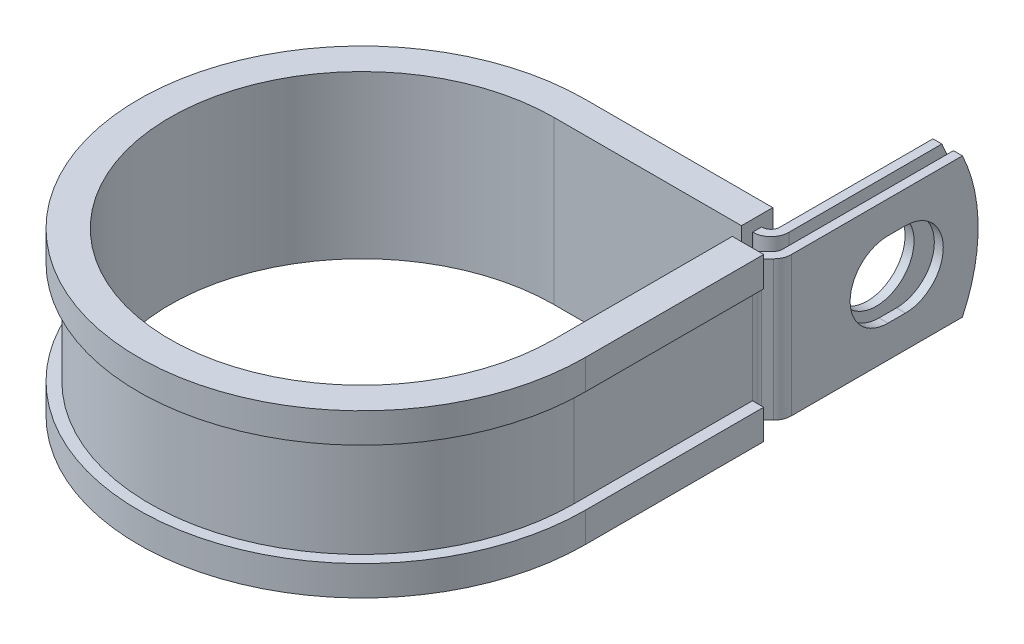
ISO-10303-21;
HEADER;
FILE_DESCRIPTION(('STEP AP214'),'2;1');
FILE_NAME('part.step','',(''),(''),'','','');
FILE_SCHEMA(('AUTOMOTIVE_DESIGN { 1 0 10303 214 1 1 1 1 }'));
ENDSEC;
DATA;
#1=APPLICATION_CONTEXT('core data for automotive mechanical design processes');
#2=APPLICATION_PROTOCOL_DEFINITION('international standard','automotive_design',2000,#1);
#3=PRODUCT_CONTEXT('',#1,'mechanical');
#4=PRODUCT('Part','Part','',(#3));
#5=PRODUCT_RELATED_PRODUCT_CATEGORY('part','',(#4));
#6=PRODUCT_DEFINITION_FORMATION('','',#4);
#7=PRODUCT_DEFINITION_CONTEXT('part definition',#1,'design');
#8=PRODUCT_DEFINITION('design','',#6,#7);
#9=PRODUCT_DEFINITION_SHAPE('','',#8);
#10=(LENGTH_UNIT() NAMED_UNIT(*) SI_UNIT(.MILLI.,.METRE.));
#11=(NAMED_UNIT(*) PLANE_ANGLE_UNIT() SI_UNIT($,.RADIAN.));
#12=(NAMED_UNIT(*) SI_UNIT($,.STERADIAN.) SOLID_ANGLE_UNIT());
#13=UNCERTAINTY_MEASURE_WITH_UNIT(LENGTH_MEASURE(1.E-05),#10,'distance_accuracy_value','');
#14=(GEOMETRIC_REPRESENTATION_CONTEXT(3) GLOBAL_UNCERTAINTY_ASSIGNED_CONTEXT((#13)) GLOBAL_UNIT_ASSIGNED_CONTEXT((#10,
#11,#12)) REPRESENTATION_CONTEXT('',''));
#15=CARTESIAN_POINT('',(0.,0.,0.));
#16=DIRECTION('',(0.,0.,1.));
#17=DIRECTION('',(1.,0.,0.));
#18=AXIS2_PLACEMENT_3D('',#15,#16,#17);
#19=CARTESIAN_POINT('',(28.3896698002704,-9.525,-27.7114));
#20=DIRECTION('',(0.,1.,0.));
#21=DIRECTION('',(1.,0.,0.));
#22=AXIS2_PLACEMENT_3D('',#19,#20,#21);
#23=PLANE('',#22);
#24=DIRECTION('',(0.,0.,-1.));
#25=VECTOR('',#24,1.);
#26=CARTESIAN_POINT('',(25.5448698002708,-9.525,-27.7114));
#27=LINE('',#26,#25);
#28=CARTESIAN_POINT('',(25.5448698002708,-9.525,-27.7114));
#29=VERTEX_POINT('',#28);
#30=CARTESIAN_POINT('',(25.5448698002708,-9.525,-28.9306));
#31=VERTEX_POINT('',#30);
#32=EDGE_CURVE('E505',#29,#31,#27,.T.);
#33=ORIENTED_EDGE('',*,*,#32,.T.);
#34=DIRECTION('',(-1.,0.,0.));
#35=VECTOR('',#34,1.);
#36=CARTESIAN_POINT('',(0.,-9.525,-28.9306));
#37=LINE('',#36,#35);
#38=CARTESIAN_POINT('',(25.5956698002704,-9.525,-28.9306));
#39=VERTEX_POINT('',#38);
#40=EDGE_CURVE('E392',#39,#31,#37,.T.);
#41=ORIENTED_EDGE('',*,*,#40,.F.);
#42=CARTESIAN_POINT('',(25.5956698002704,-9.525,-30.1498));
#43=DIRECTION('',(0.,1.,0.));
#44=DIRECTION('',(1.,0.,0.));
#45=AXIS2_PLACEMENT_3D('',#42,#43,#44);
#46=CIRCLE('',#45,1.2192);
#47=CARTESIAN_POINT('',(26.8148698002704,-9.525,-30.1498));
#48=VERTEX_POINT('',#47);
#49=EDGE_CURVE('E390',#48,#39,#46,.F.);
#50=ORIENTED_EDGE('',*,*,#49,.F.);
#51=DIRECTION('',(0.,0.,1.));
#52=VECTOR('',#51,1.);
#53=CARTESIAN_POINT('',(26.8148698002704,-9.525,-53.1622));
#54=LINE('',#53,#52);
#55=CARTESIAN_POINT('',(26.8148698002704,-9.525,-51.0176631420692));
#56=VERTEX_POINT('',#55);
#57=EDGE_CURVE('E388',#56,#48,#54,.T.);
#58=ORIENTED_EDGE('',*,*,#57,.F.);
#59=DIRECTION('',(-1.,0.,0.));
#60=VECTOR('',#59,1.);
#61=CARTESIAN_POINT('',(30.8280698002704,-9.525,-51.0176631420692));
#62=LINE('',#61,#60);
#63=CARTESIAN_POINT('',(28.0340698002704,-9.525,-51.0176631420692));
#64=VERTEX_POINT('',#63);
#65=EDGE_CURVE('E11',#64,#56,#62,.T.);
#66=ORIENTED_EDGE('',*,*,#65,.F.);
#67=DIRECTION('',(0.,0.,1.));
#68=VECTOR('',#67,1.);
#69=CARTESIAN_POINT('',(28.0340698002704,-9.525,-53.1622));
#70=LINE('',#69,#68);
#71=CARTESIAN_POINT('',(28.0340698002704,-9.525,-30.1498));
#72=VERTEX_POINT('',#71);
#73=EDGE_CURVE('E386',#64,#72,#70,.T.);
#74=ORIENTED_EDGE('',*,*,#73,.T.);
#75=CARTESIAN_POINT('',(25.5956698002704,-9.525,-30.1498));
#76=DIRECTION('',(0.,-1.,0.));
#77=DIRECTION('',(0.,0.,1.));
#78=AXIS2_PLACEMENT_3D('',#75,#76,#77);
#79=CIRCLE('',#78,2.4384);
#80=CARTESIAN_POINT('',(25.5956698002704,-9.525,-27.7114));
#81=VERTEX_POINT('',#80);
#82=EDGE_CURVE('E383',#72,#81,#79,.T.);
#83=ORIENTED_EDGE('',*,*,#82,.T.);
#84=DIRECTION('',(-1.,0.,0.));
#85=VECTOR('',#84,1.);
#86=CARTESIAN_POINT('',(0.,-9.525,-27.7114));
#87=LINE('',#86,#85);
#88=EDGE_CURVE('E380',#81,#29,#87,.T.);
#89=ORIENTED_EDGE('',*,*,#88,.T.);
#90=EDGE_LOOP('',(#33,#41,#50,#58,#66,#74,#83,#89));
#91=FACE_BOUND('',#90,.T.);
#92=ADVANCED_FACE('F36',(#91),#23,.F.);
#93=CARTESIAN_POINT('',(28.3896698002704,9.525,-27.7114));
#94=DIRECTION('',(0.,1.,0.));
#95=DIRECTION('',(1.,0.,0.));
#96=AXIS2_PLACEMENT_3D('',#93,#94,#95);
#97=PLANE('',#96);
#98=DIRECTION('',(-1.,0.,0.));
#99=VECTOR('',#98,1.);
#100=CARTESIAN_POINT('',(0.,9.525,-28.9306));
#101=LINE('',#100,#99);
#102=CARTESIAN_POINT('',(25.5956698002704,9.525,-28.9306));
#103=VERTEX_POINT('',#102);
#104=CARTESIAN_POINT('',(25.5448698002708,9.525,-28.9306));
#105=VERTEX_POINT('',#104);
#106=EDGE_CURVE('E350',#103,#105,#101,.T.);
#107=ORIENTED_EDGE('',*,*,#106,.T.);
#108=DIRECTION('',(0.,0.,1.));
#109=VECTOR('',#108,1.);
#110=CARTESIAN_POINT('',(25.5448698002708,9.525,-28.9306));
#111=LINE('',#110,#109);
#112=CARTESIAN_POINT('',(25.5448698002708,9.525,-27.7114));
#113=VERTEX_POINT('',#112);
#114=EDGE_CURVE('E499',#105,#113,#111,.T.);
#115=ORIENTED_EDGE('',*,*,#114,.T.);
#116=DIRECTION('',(-1.,0.,0.));
#117=VECTOR('',#116,1.);
#118=CARTESIAN_POINT('',(0.,9.525,-27.7114));
#119=LINE('',#118,#117);
#120=CARTESIAN_POINT('',(25.5956698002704,9.525,-27.7114));
#121=VERTEX_POINT('',#120);
#122=EDGE_CURVE('E607',#121,#113,#119,.T.);
#123=ORIENTED_EDGE('',*,*,#122,.F.);
#124=CARTESIAN_POINT('',(25.5956698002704,9.525,-30.1498));
#125=DIRECTION('',(0.,-1.,0.));
#126=DIRECTION('',(0.,0.,1.));
#127=AXIS2_PLACEMENT_3D('',#124,#125,#126);
#128=CIRCLE('',#127,2.4384);
#129=CARTESIAN_POINT('',(28.0340698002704,9.525,-30.1498));
#130=VERTEX_POINT('',#129);
#131=EDGE_CURVE('E352',#130,#121,#128,.T.);
#132=ORIENTED_EDGE('',*,*,#131,.F.);
#133=DIRECTION('',(0.,0.,1.));
#134=VECTOR('',#133,1.);
#135=CARTESIAN_POINT('',(28.0340698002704,9.525,-53.1622));
#136=LINE('',#135,#134);
#137=CARTESIAN_POINT('',(28.0340698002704,9.525,-51.0176631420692));
#138=VERTEX_POINT('',#137);
#139=EDGE_CURVE('E343',#138,#130,#136,.T.);
#140=ORIENTED_EDGE('',*,*,#139,.F.);
#141=DIRECTION('',(-1.,0.,0.));
#142=VECTOR('',#141,1.);
#143=CARTESIAN_POINT('',(30.8280698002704,9.525,-51.0176631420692));
#144=LINE('',#143,#142);
#145=CARTESIAN_POINT('',(26.8148698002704,9.525,-51.0176631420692));
#146=VERTEX_POINT('',#145);
#147=EDGE_CURVE('E44',#138,#146,#144,.T.);
#148=ORIENTED_EDGE('',*,*,#147,.T.);
#149=DIRECTION('',(0.,0.,1.));
#150=VECTOR('',#149,1.);
#151=CARTESIAN_POINT('',(26.8148698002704,9.525,-53.1622));
#152=LINE('',#151,#150);
#153=CARTESIAN_POINT('',(26.8148698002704,9.525,-30.1498));
#154=VERTEX_POINT('',#153);
#155=EDGE_CURVE('E340',#146,#154,#152,.T.);
#156=ORIENTED_EDGE('',*,*,#155,.T.);
#157=CARTESIAN_POINT('',(25.5956698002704,9.525,-30.1498));
#158=DIRECTION('',(0.,1.,0.));
#159=DIRECTION('',(1.,0.,0.));
#160=AXIS2_PLACEMENT_3D('',#157,#158,#159);
#161=CIRCLE('',#160,1.2192);
#162=EDGE_CURVE('E348',#154,#103,#161,.F.);
#163=ORIENTED_EDGE('',*,*,#162,.T.);
#164=EDGE_LOOP('',(#107,#115,#123,#132,#140,#148,#156,#163));
#165=FACE_BOUND('',#164,.T.);
#166=ADVANCED_FACE('F339',(#165),#97,.T.);
#167=CARTESIAN_POINT('',(0.,9.525,-27.7114));
#168=DIRECTION('',(0.,0.,1.));
#169=DIRECTION('',(1.,0.,0.));
#170=AXIS2_PLACEMENT_3D('',#167,#168,#169);
#171=PLANE('',#170);
#172=ORIENTED_EDGE('',*,*,#122,.T.);
#173=DIRECTION('',(0.,-1.,0.));
#174=VECTOR('',#173,1.);
#175=CARTESIAN_POINT('',(25.5448698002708,9.525,-27.7114));
#176=LINE('',#175,#174);
#177=EDGE_CURVE('E502',#113,#29,#176,.T.);
#178=ORIENTED_EDGE('',*,*,#177,.T.);
#179=ORIENTED_EDGE('',*,*,#88,.F.);
#180=DIRECTION('',(0.,-1.,0.));
#181=VECTOR('',#180,1.);
#182=CARTESIAN_POINT('',(25.5956698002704,9.525,-27.7114));
#183=LINE('',#182,#181);
#184=EDGE_CURVE('E326',#121,#81,#183,.T.);
#185=ORIENTED_EDGE('',*,*,#184,.F.);
#186=EDGE_LOOP('',(#172,#178,#179,#185));
#187=FACE_BOUND('',#186,.T.);
#188=ADVANCED_FACE('F617',(#187),#171,.T.);
#189=CARTESIAN_POINT('',(30.8280698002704,9.525,-27.7114));
#190=DIRECTION('',(-1.,0.,0.));
#191=DIRECTION('',(0.,0.,1.));
#192=AXIS2_PLACEMENT_3D('',#189,#190,#191);
#193=PLANE('',#192);
#194=CARTESIAN_POINT('',(30.8280698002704,0.,-43.2561999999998));
#195=DIRECTION('',(1.,0.,0.));
#196=DIRECTION('',(0.,0.,-1.));
#197=AXIS2_PLACEMENT_3D('',#194,#195,#196);
#198=CIRCLE('',#197,5.1562);
#199=CARTESIAN_POINT('',(30.8280698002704,-5.1562,-43.2562000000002));
#200=VERTEX_POINT('',#199);
#201=CARTESIAN_POINT('',(30.8280698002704,5.1562,-43.2562000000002));
#202=VERTEX_POINT('',#201);
#203=EDGE_CURVE('E562',#200,#202,#198,.T.);
#204=ORIENTED_EDGE('',*,*,#203,.F.);
#205=DIRECTION('',(0.,0.,-1.));
#206=VECTOR('',#205,1.);
#207=CARTESIAN_POINT('',(30.8280698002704,-5.1562,-40.8685999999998));
#208=LINE('',#207,#206);
#209=CARTESIAN_POINT('',(30.8280698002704,-5.1562,-40.8685999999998));
#210=VERTEX_POINT('',#209);
#211=EDGE_CURVE('E565',#210,#200,#208,.T.);
#212=ORIENTED_EDGE('',*,*,#211,.F.);
#213=CARTESIAN_POINT('',(30.8280698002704,0.,-40.8685999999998));
#214=DIRECTION('',(1.,0.,0.));
#215=DIRECTION('',(0.,0.,-1.));
#216=AXIS2_PLACEMENT_3D('',#213,#214,#215);
#217=CIRCLE('',#216,5.1562);
#218=CARTESIAN_POINT('',(30.8280698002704,5.1562,-40.8685999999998));
#219=VERTEX_POINT('',#218);
#220=EDGE_CURVE('E558',#219,#210,#217,.T.);
#221=ORIENTED_EDGE('',*,*,#220,.F.);
#222=DIRECTION('',(0.,0.,1.));
#223=VECTOR('',#222,1.);
#224=CARTESIAN_POINT('',(30.8280698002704,5.1562,-40.8685999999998));
#225=LINE('',#224,#223);
#226=EDGE_CURVE('E559',#202,#219,#225,.T.);
#227=ORIENTED_EDGE('',*,*,#226,.F.);
#228=EDGE_LOOP('',(#204,#212,#221,#227));
#229=FACE_BOUND('',#228,.T.);
#230=DIRECTION('',(0.,0.,-1.));
#231=VECTOR('',#230,1.);
#232=CARTESIAN_POINT('',(30.8280698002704,-9.525,-27.7114));
#233=LINE('',#232,#231);
#234=CARTESIAN_POINT('',(30.8280698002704,-9.525,-27.7114));
#235=VERTEX_POINT('',#234);
#236=CARTESIAN_POINT('',(30.8280698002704,-9.525,-51.0176631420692));
#237=VERTEX_POINT('',#236);
#238=EDGE_CURVE('E364',#235,#237,#233,.T.);
#239=ORIENTED_EDGE('',*,*,#238,.T.);
#240=CARTESIAN_POINT('',(30.8280698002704,0.,-30.9372));
#241=DIRECTION('',(-1.,0.,0.));
#242=DIRECTION('',(0.,0.,1.));
#243=AXIS2_PLACEMENT_3D('',#240,#241,#242);
#244=CIRCLE('',#243,22.225);
#245=CARTESIAN_POINT('',(30.8280698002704,9.525,-51.0176631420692));
#246=VERTEX_POINT('',#245);
#247=EDGE_CURVE('E550',#246,#237,#244,.T.);
#248=ORIENTED_EDGE('',*,*,#247,.F.);
#249=DIRECTION('',(0.,0.,-1.));
#250=VECTOR('',#249,1.);
#251=CARTESIAN_POINT('',(30.8280698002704,9.525,-27.7114));
#252=LINE('',#251,#250);
#253=CARTESIAN_POINT('',(30.8280698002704,9.525,-27.7114));
#254=VERTEX_POINT('',#253);
#255=EDGE_CURVE('E401',#254,#246,#252,.T.);
#256=ORIENTED_EDGE('',*,*,#255,.F.);
#257=DIRECTION('',(0.,-1.,0.));
#258=VECTOR('',#257,1.);
#259=CARTESIAN_POINT('',(30.8280698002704,9.525,-27.7114));
#260=LINE('',#259,#258);
#261=EDGE_CURVE('E363',#254,#235,#260,.T.);
#262=ORIENTED_EDGE('',*,*,#261,.T.);
#263=EDGE_LOOP('',(#239,#248,#256,#262));
#264=FACE_BOUND('',#263,.T.);
#265=ADVANCED_FACE('F38',(#229,#264),#193,.F.);
#266=CARTESIAN_POINT('',(29.6088698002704,9.525,-27.7114));
#267=DIRECTION('',(-1.,0.,0.));
#268=DIRECTION('',(0.,0.,1.));
#269=AXIS2_PLACEMENT_3D('',#266,#267,#268);
#270=PLANE('',#269);
#271=DIRECTION('',(0.,0.,-1.));
#272=VECTOR('',#271,1.);
#273=CARTESIAN_POINT('',(29.6088698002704,-5.1562,-40.8685999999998));
#274=LINE('',#273,#272);
#275=CARTESIAN_POINT('',(29.6088698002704,-5.1562,-40.8685999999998));
#276=VERTEX_POINT('',#275);
#277=CARTESIAN_POINT('',(29.6088698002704,-5.1562,-43.2562000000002));
#278=VERTEX_POINT('',#277);
#279=EDGE_CURVE('E561',#276,#278,#274,.T.);
#280=ORIENTED_EDGE('',*,*,#279,.T.);
#281=CARTESIAN_POINT('',(29.6088698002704,0.,-43.2561999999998));
#282=DIRECTION('',(-1.,0.,0.));
#283=DIRECTION('',(0.,0.,1.));
#284=AXIS2_PLACEMENT_3D('',#281,#282,#283);
#285=CIRCLE('',#284,5.1562);
#286=CARTESIAN_POINT('',(29.6088698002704,5.1562,-43.2562000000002));
#287=VERTEX_POINT('',#286);
#288=EDGE_CURVE('E582',#278,#287,#285,.F.);
#289=ORIENTED_EDGE('',*,*,#288,.T.);
#290=DIRECTION('',(0.,0.,1.));
#291=VECTOR('',#290,1.);
#292=CARTESIAN_POINT('',(29.6088698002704,5.1562,-40.8685999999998));
#293=LINE('',#292,#291);
#294=CARTESIAN_POINT('',(29.6088698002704,5.1562,-40.8685999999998));
#295=VERTEX_POINT('',#294);
#296=EDGE_CURVE('E578',#287,#295,#293,.T.);
#297=ORIENTED_EDGE('',*,*,#296,.T.);
#298=CARTESIAN_POINT('',(29.6088698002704,0.,-40.8685999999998));
#299=DIRECTION('',(-1.,0.,0.));
#300=DIRECTION('',(0.,0.,1.));
#301=AXIS2_PLACEMENT_3D('',#298,#299,#300);
#302=CIRCLE('',#301,5.1562);
#303=EDGE_CURVE('E573',#295,#276,#302,.F.);
#304=ORIENTED_EDGE('',*,*,#303,.T.);
#305=EDGE_LOOP('',(#280,#289,#297,#304));
#306=FACE_BOUND('',#305,.T.);
#307=CARTESIAN_POINT('',(29.6088698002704,0.,-30.9372));
#308=DIRECTION('',(-1.,0.,0.));
#309=DIRECTION('',(0.,0.,1.));
#310=AXIS2_PLACEMENT_3D('',#307,#308,#309);
#311=CIRCLE('',#310,22.225);
#312=CARTESIAN_POINT('',(29.6088698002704,9.525,-51.0176631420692));
#313=VERTEX_POINT('',#312);
#314=CARTESIAN_POINT('',(29.6088698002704,-9.525,-51.0176631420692));
#315=VERTEX_POINT('',#314);
#316=EDGE_CURVE('E58',#313,#315,#311,.T.);
#317=ORIENTED_EDGE('',*,*,#316,.T.);
#318=DIRECTION('',(0.,0.,-1.));
#319=VECTOR('',#318,1.);
#320=CARTESIAN_POINT('',(29.6088698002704,-9.525,-27.7114));
#321=LINE('',#320,#319);
#322=CARTESIAN_POINT('',(29.6088698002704,-9.525,-27.7114));
#323=VERTEX_POINT('',#322);
#324=EDGE_CURVE('E367',#323,#315,#321,.T.);
#325=ORIENTED_EDGE('',*,*,#324,.F.);
#326=DIRECTION('',(0.,-1.,0.));
#327=VECTOR('',#326,1.);
#328=CARTESIAN_POINT('',(29.6088698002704,9.525,-27.7114));
#329=LINE('',#328,#327);
#330=CARTESIAN_POINT('',(29.6088698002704,9.525,-27.7114));
#331=VERTEX_POINT('',#330);
#332=EDGE_CURVE('E334',#331,#323,#329,.T.);
#333=ORIENTED_EDGE('',*,*,#332,.F.);
#334=DIRECTION('',(0.,0.,-1.));
#335=VECTOR('',#334,1.);
#336=CARTESIAN_POINT('',(29.6088698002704,9.525,-27.7114));
#337=LINE('',#336,#335);
#338=EDGE_CURVE('E597',#331,#313,#337,.T.);
#339=ORIENTED_EDGE('',*,*,#338,.T.);
#340=EDGE_LOOP('',(#317,#325,#333,#339));
#341=FACE_BOUND('',#340,.T.);
#342=ADVANCED_FACE('F671',(#306,#341),#270,.T.);
#343=CARTESIAN_POINT('',(28.0340698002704,9.525,-53.1622));
#344=DIRECTION('',(1.,0.,0.));
#345=DIRECTION('',(0.,0.,-1.));
#346=AXIS2_PLACEMENT_3D('',#343,#344,#345);
#347=PLANE('',#346);
#348=CARTESIAN_POINT('',(28.0340698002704,0.,-42.0624));
#349=DIRECTION('',(1.,0.,0.));
#350=DIRECTION('',(0.,0.,-1.));
#351=AXIS2_PLACEMENT_3D('',#348,#349,#350);
#352=CIRCLE('',#351,5.1562);
#353=CARTESIAN_POINT('',(28.0340698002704,0.,-47.2186));
#354=VERTEX_POINT('',#353);
#355=EDGE_CURVE('E368',#354,#354,#352,.F.);
#356=ORIENTED_EDGE('',*,*,#355,.T.);
#357=EDGE_LOOP('',(#356));
#358=FACE_BOUND('',#357,.T.);
#359=ORIENTED_EDGE('',*,*,#73,.F.);
#360=CARTESIAN_POINT('',(28.0340698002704,0.,-30.9372));
#361=DIRECTION('',(1.,0.,0.));
#362=DIRECTION('',(0.,0.,-1.));
#363=AXIS2_PLACEMENT_3D('',#360,#361,#362);
#364=CIRCLE('',#363,22.225);
#365=EDGE_CURVE('E555',#64,#138,#364,.T.);
#366=ORIENTED_EDGE('',*,*,#365,.T.);
#367=ORIENTED_EDGE('',*,*,#139,.T.);
#368=DIRECTION('',(0.,-1.,0.));
#369=VECTOR('',#368,1.);
#370=CARTESIAN_POINT('',(28.0340698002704,9.525,-30.1498));
#371=LINE('',#370,#369);
#372=EDGE_CURVE('E323',#130,#72,#371,.T.);
#373=ORIENTED_EDGE('',*,*,#372,.T.);
#374=EDGE_LOOP('',(#359,#366,#367,#373));
#375=FACE_BOUND('',#374,.T.);
#376=ADVANCED_FACE('F623',(#358,#375),#347,.T.);
#377=CARTESIAN_POINT('',(26.8148698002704,9.525,-53.1622));
#378=DIRECTION('',(1.,0.,0.));
#379=DIRECTION('',(0.,0.,-1.));
#380=AXIS2_PLACEMENT_3D('',#377,#378,#379);
#381=PLANE('',#380);
#382=CARTESIAN_POINT('',(26.8148698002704,0.,-42.0624));
#383=DIRECTION('',(-1.,0.,0.));
#384=DIRECTION('',(0.,0.,1.));
#385=AXIS2_PLACEMENT_3D('',#382,#383,#384);
#386=CIRCLE('',#385,5.1562);
#387=CARTESIAN_POINT('',(26.8148698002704,0.,-36.9062));
#388=VERTEX_POINT('',#387);
#389=EDGE_CURVE('E590',#388,#388,#386,.T.);
#390=ORIENTED_EDGE('',*,*,#389,.F.);
#391=EDGE_LOOP('',(#390));
#392=FACE_BOUND('',#391,.T.);
#393=CARTESIAN_POINT('',(26.8148698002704,0.,-30.9372));
#394=DIRECTION('',(-1.,0.,0.));
#395=DIRECTION('',(0.,0.,1.));
#396=AXIS2_PLACEMENT_3D('',#393,#394,#395);
#397=CIRCLE('',#396,22.225);
#398=EDGE_CURVE('E50',#146,#56,#397,.T.);
#399=ORIENTED_EDGE('',*,*,#398,.T.);
#400=ORIENTED_EDGE('',*,*,#57,.T.);
#401=DIRECTION('',(0.,-1.,0.));
#402=VECTOR('',#401,1.);
#403=CARTESIAN_POINT('',(26.8148698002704,9.525,-30.1498));
#404=LINE('',#403,#402);
#405=EDGE_CURVE('E320',#154,#48,#404,.T.);
#406=ORIENTED_EDGE('',*,*,#405,.F.);
#407=ORIENTED_EDGE('',*,*,#155,.F.);
#408=EDGE_LOOP('',(#399,#400,#406,#407));
#409=FACE_BOUND('',#408,.T.);
#410=ADVANCED_FACE('F346',(#392,#409),#381,.F.);
#411=CARTESIAN_POINT('',(30.1498,-9.525,-24.2989026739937));
#412=DIRECTION('',(0.,1.,0.));
#413=DIRECTION('',(1.,0.,0.));
#414=AXIS2_PLACEMENT_3D('',#411,#412,#413);
#415=CIRCLE('',#414,1.2192);
#416=CARTESIAN_POINT('',(28.9306,-9.525,-24.2989026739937));
#417=VERTEX_POINT('',#416);
#418=CARTESIAN_POINT('',(29.2876954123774,-9.525,-25.1610072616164));
#419=VERTEX_POINT('',#418);
#420=EDGE_CURVE('E395',#417,#419,#415,.F.);
#421=ORIENTED_EDGE('',*,*,#420,.F.);
#422=DIRECTION('',(1.,0.,0.));
#423=VECTOR('',#422,1.);
#424=CARTESIAN_POINT('',(27.7114,-9.525,-24.2989026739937));
#425=LINE('',#424,#423);
#426=CARTESIAN_POINT('',(27.7114,-9.525,-24.2989026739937));
#427=VERTEX_POINT('',#426);
#428=EDGE_CURVE('E433',#427,#417,#425,.T.);
#429=ORIENTED_EDGE('',*,*,#428,.F.);
#430=CARTESIAN_POINT('',(30.1498,-9.525,-24.2989026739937));
#431=DIRECTION('',(0.,-1.,0.));
#432=DIRECTION('',(0.,0.,1.));
#433=AXIS2_PLACEMENT_3D('',#430,#431,#432);
#434=CIRCLE('',#433,2.4384);
#435=CARTESIAN_POINT('',(28.4255908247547,-9.525,-26.023111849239));
#436=VERTEX_POINT('',#435);
#437=EDGE_CURVE('E377',#427,#436,#434,.T.);
#438=ORIENTED_EDGE('',*,*,#437,.T.);
#439=DIRECTION('',(0.707106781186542,0.,-0.707106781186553));
#440=VECTOR('',#439,1.);
#441=CARTESIAN_POINT('',(28.4255908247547,-9.525,-26.023111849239));
#442=LINE('',#441,#440);
#443=CARTESIAN_POINT('',(29.2517743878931,-9.525,-26.8492954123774));
#444=VERTEX_POINT('',#443);
#445=EDGE_CURVE('E374',#436,#444,#442,.T.);
#446=ORIENTED_EDGE('',*,*,#445,.T.);
#447=CARTESIAN_POINT('',(28.3896698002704,-9.525,-27.7114));
#448=DIRECTION('',(0.,1.,0.));
#449=DIRECTION('',(0.,0.,1.));
#450=AXIS2_PLACEMENT_3D('',#447,#448,#449);
#451=CIRCLE('',#450,1.2192);
#452=EDGE_CURVE('E371',#444,#323,#451,.T.);
#453=ORIENTED_EDGE('',*,*,#452,.T.);
#454=ORIENTED_EDGE('',*,*,#324,.T.);
#455=DIRECTION('',(-1.,0.,0.));
#456=VECTOR('',#455,1.);
#457=CARTESIAN_POINT('',(30.8280698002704,-9.525,-51.0176631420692));
#458=LINE('',#457,#456);
#459=EDGE_CURVE('E548',#237,#315,#458,.T.);
#460=ORIENTED_EDGE('',*,*,#459,.F.);
#461=ORIENTED_EDGE('',*,*,#238,.F.);
#462=CARTESIAN_POINT('',(28.3896698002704,-9.525,-27.7114));
#463=DIRECTION('',(0.,1.,0.));
#464=DIRECTION('',(1.,0.,0.));
#465=AXIS2_PLACEMENT_3D('',#462,#463,#464);
#466=CIRCLE('',#465,2.4384);
#467=CARTESIAN_POINT('',(30.1138789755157,-9.525,-25.9871908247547));
#468=VERTEX_POINT('',#467);
#469=EDGE_CURVE('E399',#468,#235,#466,.T.);
#470=ORIENTED_EDGE('',*,*,#469,.F.);
#471=DIRECTION('',(0.707106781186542,0.,-0.707106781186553));
#472=VECTOR('',#471,1.);
#473=CARTESIAN_POINT('',(29.2876954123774,-9.525,-25.1610072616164));
#474=LINE('',#473,#472);
#475=EDGE_CURVE('E397',#419,#468,#474,.T.);
#476=ORIENTED_EDGE('',*,*,#475,.F.);
#477=EDGE_LOOP('',(#421,#429,#438,#446,#453,#454,#460,#461,#470,#476));
#478=FACE_BOUND('',#477,.T.);
#479=ADVANCED_FACE('F657',(#478),#23,.F.);
#480=DIRECTION('',(-1.,0.,0.));
#481=VECTOR('',#480,1.);
#482=CARTESIAN_POINT('',(28.9306,9.525,-24.2989026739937));
#483=LINE('',#482,#481);
#484=CARTESIAN_POINT('',(28.9306,9.525,-24.2989026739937));
#485=VERTEX_POINT('',#484);
#486=CARTESIAN_POINT('',(27.7114,9.525,-24.2989026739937));
#487=VERTEX_POINT('',#486);
#488=EDGE_CURVE('E422',#485,#487,#483,.T.);
#489=ORIENTED_EDGE('',*,*,#488,.F.);
#490=CARTESIAN_POINT('',(30.1498,9.525,-24.2989026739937));
#491=DIRECTION('',(0.,1.,0.));
#492=DIRECTION('',(1.,0.,0.));
#493=AXIS2_PLACEMENT_3D('',#490,#491,#492);
#494=CIRCLE('',#493,1.2192);
#495=CARTESIAN_POINT('',(29.2876954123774,9.525,-25.1610072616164));
#496=VERTEX_POINT('',#495);
#497=EDGE_CURVE('E357',#485,#496,#494,.F.);
#498=ORIENTED_EDGE('',*,*,#497,.T.);
#499=DIRECTION('',(0.707106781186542,0.,-0.707106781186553));
#500=VECTOR('',#499,1.);
#501=CARTESIAN_POINT('',(29.2876954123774,9.525,-25.1610072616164));
#502=LINE('',#501,#500);
#503=CARTESIAN_POINT('',(30.1138789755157,9.525,-25.9871908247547));
#504=VERTEX_POINT('',#503);
#505=EDGE_CURVE('E359',#496,#504,#502,.T.);
#506=ORIENTED_EDGE('',*,*,#505,.T.);
#507=CARTESIAN_POINT('',(28.3896698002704,9.525,-27.7114));
#508=DIRECTION('',(0.,1.,0.));
#509=DIRECTION('',(1.,0.,0.));
#510=AXIS2_PLACEMENT_3D('',#507,#508,#509);
#511=CIRCLE('',#510,2.4384);
#512=EDGE_CURVE('E361',#504,#254,#511,.T.);
#513=ORIENTED_EDGE('',*,*,#512,.T.);
#514=ORIENTED_EDGE('',*,*,#255,.T.);
#515=DIRECTION('',(-1.,0.,0.));
#516=VECTOR('',#515,1.);
#517=CARTESIAN_POINT('',(30.8280698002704,9.525,-51.0176631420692));
#518=LINE('',#517,#516);
#519=EDGE_CURVE('E552',#246,#313,#518,.T.);
#520=ORIENTED_EDGE('',*,*,#519,.T.);
#521=ORIENTED_EDGE('',*,*,#338,.F.);
#522=CARTESIAN_POINT('',(28.3896698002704,9.525,-27.7114));
#523=DIRECTION('',(0.,1.,0.));
#524=DIRECTION('',(0.,0.,1.));
#525=AXIS2_PLACEMENT_3D('',#522,#523,#524);
#526=CIRCLE('',#525,1.2192);
#527=CARTESIAN_POINT('',(29.2517743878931,9.525,-26.8492954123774));
#528=VERTEX_POINT('',#527);
#529=EDGE_CURVE('E600',#528,#331,#526,.T.);
#530=ORIENTED_EDGE('',*,*,#529,.F.);
#531=DIRECTION('',(0.707106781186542,0.,-0.707106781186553));
#532=VECTOR('',#531,1.);
#533=CARTESIAN_POINT('',(28.4255908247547,9.525,-26.023111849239));
#534=LINE('',#533,#532);
#535=CARTESIAN_POINT('',(28.4255908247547,9.525,-26.023111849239));
#536=VERTEX_POINT('',#535);
#537=EDGE_CURVE('E603',#536,#528,#534,.T.);
#538=ORIENTED_EDGE('',*,*,#537,.F.);
#539=CARTESIAN_POINT('',(30.1498,9.525,-24.2989026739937));
#540=DIRECTION('',(0.,-1.,0.));
#541=DIRECTION('',(0.,0.,1.));
#542=AXIS2_PLACEMENT_3D('',#539,#540,#541);
#543=CIRCLE('',#542,2.4384);
#544=EDGE_CURVE('E432',#487,#536,#543,.T.);
#545=ORIENTED_EDGE('',*,*,#544,.F.);
#546=EDGE_LOOP('',(#489,#498,#506,#513,#514,#520,#521,#530,#538,#545));
#547=FACE_BOUND('',#546,.T.);
#548=ADVANCED_FACE('F429',(#547),#97,.T.);
#549=CARTESIAN_POINT('',(28.3896698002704,9.525,-27.7114));
#550=DIRECTION('',(0.,-1.,0.));
#551=DIRECTION('',(0.,0.,-1.));
#552=AXIS2_PLACEMENT_3D('',#549,#550,#551);
#553=CYLINDRICAL_SURFACE('',#552,1.2192);
#554=ORIENTED_EDGE('',*,*,#452,.F.);
#555=DIRECTION('',(0.,-1.,0.));
#556=VECTOR('',#555,1.);
#557=CARTESIAN_POINT('',(29.2517743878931,9.525,-26.8492954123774));
#558=LINE('',#557,#556);
#559=EDGE_CURVE('E332',#528,#444,#558,.T.);
#560=ORIENTED_EDGE('',*,*,#559,.F.);
#561=ORIENTED_EDGE('',*,*,#529,.T.);
#562=ORIENTED_EDGE('',*,*,#332,.T.);
#563=EDGE_LOOP('',(#554,#560,#561,#562));
#564=FACE_BOUND('',#563,.T.);
#565=ADVANCED_FACE('F667',(#564),#553,.F.);
#566=CARTESIAN_POINT('',(28.4255908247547,9.525,-26.023111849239));
#567=DIRECTION('',(-0.707106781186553,0.,-0.707106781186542));
#568=DIRECTION('',(-0.707106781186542,0.,0.707106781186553));
#569=AXIS2_PLACEMENT_3D('',#566,#567,#568);
#570=PLANE('',#569);
#571=ORIENTED_EDGE('',*,*,#445,.F.);
#572=DIRECTION('',(0.,-1.,0.));
#573=VECTOR('',#572,1.);
#574=CARTESIAN_POINT('',(28.4255908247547,9.525,-26.023111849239));
#575=LINE('',#574,#573);
#576=EDGE_CURVE('E330',#536,#436,#575,.T.);
#577=ORIENTED_EDGE('',*,*,#576,.F.);
#578=ORIENTED_EDGE('',*,*,#537,.T.);
#579=ORIENTED_EDGE('',*,*,#559,.T.);
#580=EDGE_LOOP('',(#571,#577,#578,#579));
#581=FACE_BOUND('',#580,.T.);
#582=ADVANCED_FACE('F662',(#581),#570,.T.);
#583=CARTESIAN_POINT('',(30.1498,9.525,-24.2989026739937));
#584=DIRECTION('',(0.,-1.,0.));
#585=DIRECTION('',(0.,0.,-1.));
#586=AXIS2_PLACEMENT_3D('',#583,#584,#585);
#587=CYLINDRICAL_SURFACE('',#586,2.4384);
#588=ORIENTED_EDGE('',*,*,#437,.F.);
#589=DIRECTION('',(0.,-1.,0.));
#590=VECTOR('',#589,1.);
#591=CARTESIAN_POINT('',(27.7114,9.525,-24.2989026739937));
#592=LINE('',#591,#590);
#593=EDGE_CURVE('E328',#487,#427,#592,.T.);
#594=ORIENTED_EDGE('',*,*,#593,.F.);
#595=ORIENTED_EDGE('',*,*,#544,.T.);
#596=ORIENTED_EDGE('',*,*,#576,.T.);
#597=EDGE_LOOP('',(#588,#594,#595,#596));
#598=FACE_BOUND('',#597,.T.);
#599=ADVANCED_FACE('F659',(#598),#587,.T.);
#600=CARTESIAN_POINT('',(25.5956698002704,9.525,-30.1498));
#601=DIRECTION('',(0.,-1.,0.));
#602=DIRECTION('',(0.,0.,-1.));
#603=AXIS2_PLACEMENT_3D('',#600,#601,#602);
#604=CYLINDRICAL_SURFACE('',#603,2.4384);
#605=ORIENTED_EDGE('',*,*,#82,.F.);
#606=ORIENTED_EDGE('',*,*,#372,.F.);
#607=ORIENTED_EDGE('',*,*,#131,.T.);
#608=ORIENTED_EDGE('',*,*,#184,.T.);
#609=EDGE_LOOP('',(#605,#606,#607,#608));
#610=FACE_BOUND('',#609,.T.);
#611=ADVANCED_FACE('F613',(#610),#604,.T.);
#612=CARTESIAN_POINT('',(25.5956698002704,9.525,-30.1498));
#613=DIRECTION('',(0.,-1.,0.));
#614=DIRECTION('',(0.,0.,-1.));
#615=AXIS2_PLACEMENT_3D('',#612,#613,#614);
#616=CYLINDRICAL_SURFACE('',#615,1.2192);
#617=ORIENTED_EDGE('',*,*,#49,.T.);
#618=DIRECTION('',(0.,-1.,0.));
#619=VECTOR('',#618,1.);
#620=CARTESIAN_POINT('',(25.5956698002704,9.525,-28.9306));
#621=LINE('',#620,#619);
#622=EDGE_CURVE('E311',#103,#39,#621,.T.);
#623=ORIENTED_EDGE('',*,*,#622,.F.);
#624=ORIENTED_EDGE('',*,*,#162,.F.);
#625=ORIENTED_EDGE('',*,*,#405,.T.);
#626=EDGE_LOOP('',(#617,#623,#624,#625));
#627=FACE_BOUND('',#626,.T.);
#628=ADVANCED_FACE('F628',(#627),#616,.F.);
#629=CARTESIAN_POINT('',(0.,9.525,-28.9306));
#630=DIRECTION('',(0.,0.,1.));
#631=DIRECTION('',(1.,0.,0.));
#632=AXIS2_PLACEMENT_3D('',#629,#630,#631);
#633=PLANE('',#632);
#634=DIRECTION('',(0.,-1.,0.));
#635=VECTOR('',#634,1.);
#636=CARTESIAN_POINT('',(0.,9.525,-28.9306));
#637=LINE('',#636,#635);
#638=CARTESIAN_POINT('',(4.05814088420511E-13,6.985,-28.9306));
#639=VERTEX_POINT('',#638);
#640=CARTESIAN_POINT('',(4.05814088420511E-13,-6.985,-28.9306));
#641=VERTEX_POINT('',#640);
#642=EDGE_CURVE('E302',#639,#641,#637,.T.);
#643=ORIENTED_EDGE('',*,*,#642,.F.);
#644=DIRECTION('',(1.,0.,0.));
#645=VECTOR('',#644,1.);
#646=CARTESIAN_POINT('',(4.05814088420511E-13,6.985,-28.9306));
#647=LINE('',#646,#645);
#648=CARTESIAN_POINT('',(25.5448698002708,6.985,-28.9306));
#649=VERTEX_POINT('',#648);
#650=EDGE_CURVE('E545',#639,#649,#647,.T.);
#651=ORIENTED_EDGE('',*,*,#650,.T.);
#652=DIRECTION('',(0.,1.,0.));
#653=VECTOR('',#652,1.);
#654=CARTESIAN_POINT('',(25.5448698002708,9.525,-28.9306));
#655=LINE('',#654,#653);
#656=EDGE_CURVE('E496',#649,#105,#655,.T.);
#657=ORIENTED_EDGE('',*,*,#656,.T.);
#658=ORIENTED_EDGE('',*,*,#106,.F.);
#659=ORIENTED_EDGE('',*,*,#622,.T.);
#660=ORIENTED_EDGE('',*,*,#40,.T.);
#661=DIRECTION('',(0.,1.,0.));
#662=VECTOR('',#661,1.);
#663=CARTESIAN_POINT('',(25.5448698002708,-9.525,-28.9306));
#664=LINE('',#663,#662);
#665=CARTESIAN_POINT('',(25.5448698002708,-6.985,-28.9306));
#666=VERTEX_POINT('',#665);
#667=EDGE_CURVE('E508',#31,#666,#664,.T.);
#668=ORIENTED_EDGE('',*,*,#667,.T.);
#669=DIRECTION('',(1.,0.,0.));
#670=VECTOR('',#669,1.);
#671=CARTESIAN_POINT('',(4.05814088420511E-13,-6.985,-28.9306));
#672=LINE('',#671,#670);
#673=EDGE_CURVE('E525',#641,#666,#672,.T.);
#674=ORIENTED_EDGE('',*,*,#673,.F.);
#675=EDGE_LOOP('',(#643,#651,#657,#658,#659,#660,#668,#674));
#676=FACE_BOUND('',#675,.T.);
#677=ADVANCED_FACE('F632',(#676),#633,.F.);
#678=CARTESIAN_POINT('',(0.,9.525,0.));
#679=DIRECTION('',(0.,-1.,0.));
#680=DIRECTION('',(0.,0.,-1.));
#681=AXIS2_PLACEMENT_3D('',#678,#679,#680);
#682=CYLINDRICAL_SURFACE('',#681,28.9306);
#683=DIRECTION('',(0.,-1.,0.));
#684=VECTOR('',#683,1.);
#685=CARTESIAN_POINT('',(28.9306,9.525,0.));
#686=LINE('',#685,#684);
#687=CARTESIAN_POINT('',(28.9306,6.985,0.));
#688=VERTEX_POINT('',#687);
#689=CARTESIAN_POINT('',(28.9306,-6.985,0.));
#690=VERTEX_POINT('',#689);
#691=EDGE_CURVE('E300',#688,#690,#686,.T.);
#692=ORIENTED_EDGE('',*,*,#691,.F.);
#693=CARTESIAN_POINT('',(0.,6.985,0.));
#694=DIRECTION('',(0.,-1.,0.));
#695=DIRECTION('',(0.,0.,-1.));
#696=AXIS2_PLACEMENT_3D('',#693,#694,#695);
#697=CIRCLE('',#696,28.9306);
#698=EDGE_CURVE('E494',#688,#639,#697,.T.);
#699=ORIENTED_EDGE('',*,*,#698,.T.);
#700=ORIENTED_EDGE('',*,*,#642,.T.);
#701=CARTESIAN_POINT('',(0.,-6.985,0.));
#702=DIRECTION('',(0.,-1.,0.));
#703=DIRECTION('',(0.,0.,-1.));
#704=AXIS2_PLACEMENT_3D('',#701,#702,#703);
#705=CIRCLE('',#704,28.9306);
#706=EDGE_CURVE('E283',#690,#641,#705,.T.);
#707=ORIENTED_EDGE('',*,*,#706,.F.);
#708=EDGE_LOOP('',(#692,#699,#700,#707));
#709=FACE_BOUND('',#708,.T.);
#710=ADVANCED_FACE('F298',(#709),#682,.T.);
#711=CARTESIAN_POINT('',(28.9306,9.525,0.));
#712=DIRECTION('',(-1.,0.,0.));
#713=DIRECTION('',(0.,0.,1.));
#714=AXIS2_PLACEMENT_3D('',#711,#712,#713);
#715=PLANE('',#714);
#716=DIRECTION('',(0.,-1.,0.));
#717=VECTOR('',#716,1.);
#718=CARTESIAN_POINT('',(28.9306,9.525,-24.2989026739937));
#719=LINE('',#718,#717);
#720=CARTESIAN_POINT('',(28.9306,6.985,-24.2989026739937));
#721=VERTEX_POINT('',#720);
#722=CARTESIAN_POINT('',(28.9306,-6.985,-24.2989026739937));
#723=VERTEX_POINT('',#722);
#724=EDGE_CURVE('E314',#721,#723,#719,.T.);
#725=ORIENTED_EDGE('',*,*,#724,.F.);
#726=DIRECTION('',(0.,0.,-1.));
#727=VECTOR('',#726,1.);
#728=CARTESIAN_POINT('',(28.9306,6.985,0.));
#729=LINE('',#728,#727);
#730=EDGE_CURVE('E308',#688,#721,#729,.T.);
#731=ORIENTED_EDGE('',*,*,#730,.F.);
#732=ORIENTED_EDGE('',*,*,#691,.T.);
#733=DIRECTION('',(0.,0.,-1.));
#734=VECTOR('',#733,1.);
#735=CARTESIAN_POINT('',(28.9306,-6.985,0.));
#736=LINE('',#735,#734);
#737=EDGE_CURVE('E279',#690,#723,#736,.T.);
#738=ORIENTED_EDGE('',*,*,#737,.T.);
#739=EDGE_LOOP('',(#725,#731,#732,#738));
#740=FACE_BOUND('',#739,.T.);
#741=ADVANCED_FACE('F307',(#740),#715,.F.);
#742=CARTESIAN_POINT('',(30.1498,9.525,-24.2989026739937));
#743=DIRECTION('',(0.,-1.,0.));
#744=DIRECTION('',(0.,0.,-1.));
#745=AXIS2_PLACEMENT_3D('',#742,#743,#744);
#746=CYLINDRICAL_SURFACE('',#745,1.2192);
#747=ORIENTED_EDGE('',*,*,#420,.T.);
#748=DIRECTION('',(0.,-1.,0.));
#749=VECTOR('',#748,1.);
#750=CARTESIAN_POINT('',(29.2876954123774,9.525,-25.1610072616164));
#751=LINE('',#750,#749);
#752=EDGE_CURVE('E406',#496,#419,#751,.T.);
#753=ORIENTED_EDGE('',*,*,#752,.F.);
#754=ORIENTED_EDGE('',*,*,#497,.F.);
#755=EDGE_CURVE('E309',#485,#721,#719,.T.);
#756=ORIENTED_EDGE('',*,*,#755,.T.);
#757=ORIENTED_EDGE('',*,*,#724,.T.);
#758=DIRECTION('',(0.,1.,0.));
#759=VECTOR('',#758,1.);
#760=CARTESIAN_POINT('',(28.9306,-9.525,-24.2989026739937));
#761=LINE('',#760,#759);
#762=EDGE_CURVE('E415',#417,#723,#761,.T.);
#763=ORIENTED_EDGE('',*,*,#762,.F.);
#764=EDGE_LOOP('',(#747,#753,#754,#756,#757,#763));
#765=FACE_BOUND('',#764,.T.);
#766=ADVANCED_FACE('F414',(#765),#746,.F.);
#767=CARTESIAN_POINT('',(29.2876954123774,9.525,-25.1610072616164));
#768=DIRECTION('',(-0.707106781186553,0.,-0.707106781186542));
#769=DIRECTION('',(-0.707106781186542,0.,0.707106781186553));
#770=AXIS2_PLACEMENT_3D('',#767,#768,#769);
#771=PLANE('',#770);
#772=ORIENTED_EDGE('',*,*,#475,.T.);
#773=DIRECTION('',(0.,-1.,0.));
#774=VECTOR('',#773,1.);
#775=CARTESIAN_POINT('',(30.1138789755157,9.525,-25.9871908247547));
#776=LINE('',#775,#774);
#777=EDGE_CURVE('E404',#504,#468,#776,.T.);
#778=ORIENTED_EDGE('',*,*,#777,.F.);
#779=ORIENTED_EDGE('',*,*,#505,.F.);
#780=ORIENTED_EDGE('',*,*,#752,.T.);
#781=EDGE_LOOP('',(#772,#778,#779,#780));
#782=FACE_BOUND('',#781,.T.);
#783=ADVANCED_FACE('F683',(#782),#771,.F.);
#784=CARTESIAN_POINT('',(28.3896698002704,9.525,-27.7114));
#785=DIRECTION('',(0.,-1.,0.));
#786=DIRECTION('',(0.,0.,-1.));
#787=AXIS2_PLACEMENT_3D('',#784,#785,#786);
#788=CYLINDRICAL_SURFACE('',#787,2.4384);
#789=ORIENTED_EDGE('',*,*,#469,.T.);
#790=ORIENTED_EDGE('',*,*,#261,.F.);
#791=ORIENTED_EDGE('',*,*,#512,.F.);
#792=ORIENTED_EDGE('',*,*,#777,.T.);
#793=EDGE_LOOP('',(#789,#790,#791,#792));
#794=FACE_BOUND('',#793,.T.);
#795=ADVANCED_FACE('F681',(#794),#788,.T.);
#796=CARTESIAN_POINT('',(42.6180057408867,0.,-42.0624));
#797=DIRECTION('',(-1.,0.,0.));
#798=DIRECTION('',(0.,0.,1.));
#799=AXIS2_PLACEMENT_3D('',#796,#797,#798);
#800=CYLINDRICAL_SURFACE('',#799,5.1562);
#801=ORIENTED_EDGE('',*,*,#389,.T.);
#802=EDGE_LOOP('',(#801));
#803=FACE_BOUND('',#802,.T.);
#804=ORIENTED_EDGE('',*,*,#355,.F.);
#805=EDGE_LOOP('',(#804));
#806=FACE_BOUND('',#805,.T.);
#807=ADVANCED_FACE('F690',(#803,#806),#800,.F.);
#808=CARTESIAN_POINT('',(13.2492978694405,-5.1562,-40.8685999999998));
#809=DIRECTION('',(0.,-1.,0.));
#810=DIRECTION('',(0.,0.,-1.));
#811=AXIS2_PLACEMENT_3D('',#808,#809,#810);
#812=PLANE('',#811);
#813=DIRECTION('',(1.,0.,0.));
#814=VECTOR('',#813,1.);
#815=CARTESIAN_POINT('',(13.2492978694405,-5.1562,-40.8685999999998));
#816=LINE('',#815,#814);
#817=EDGE_CURVE('E576',#276,#210,#816,.T.);
#818=ORIENTED_EDGE('',*,*,#817,.T.);
#819=ORIENTED_EDGE('',*,*,#211,.T.);
#820=DIRECTION('',(1.,0.,0.));
#821=VECTOR('',#820,1.);
#822=CARTESIAN_POINT('',(13.2492978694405,-5.1562,-43.2562000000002));
#823=LINE('',#822,#821);
#824=EDGE_CURVE('E572',#278,#200,#823,.T.);
#825=ORIENTED_EDGE('',*,*,#824,.F.);
#826=ORIENTED_EDGE('',*,*,#279,.F.);
#827=EDGE_LOOP('',(#818,#819,#825,#826));
#828=FACE_BOUND('',#827,.T.);
#829=ADVANCED_FACE('F733',(#828),#812,.F.);
#830=CARTESIAN_POINT('',(13.2492978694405,0.,-43.2561999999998));
#831=DIRECTION('',(1.,0.,0.));
#832=DIRECTION('',(0.,0.,-1.));
#833=AXIS2_PLACEMENT_3D('',#830,#831,#832);
#834=CYLINDRICAL_SURFACE('',#833,5.1562);
#835=ORIENTED_EDGE('',*,*,#824,.T.);
#836=ORIENTED_EDGE('',*,*,#203,.T.);
#837=DIRECTION('',(1.,0.,0.));
#838=VECTOR('',#837,1.);
#839=CARTESIAN_POINT('',(13.2492978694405,5.1562,-43.2562000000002));
#840=LINE('',#839,#838);
#841=EDGE_CURVE('E581',#287,#202,#840,.T.);
#842=ORIENTED_EDGE('',*,*,#841,.F.);
#843=ORIENTED_EDGE('',*,*,#288,.F.);
#844=EDGE_LOOP('',(#835,#836,#842,#843));
#845=FACE_BOUND('',#844,.T.);
#846=ADVANCED_FACE('F737',(#845),#834,.F.);
#847=CARTESIAN_POINT('',(13.2492978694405,5.1562,-40.8685999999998));
#848=DIRECTION('',(0.,1.,0.));
#849=DIRECTION('',(0.,0.,1.));
#850=AXIS2_PLACEMENT_3D('',#847,#848,#849);
#851=PLANE('',#850);
#852=ORIENTED_EDGE('',*,*,#841,.T.);
#853=ORIENTED_EDGE('',*,*,#226,.T.);
#854=DIRECTION('',(1.,0.,0.));
#855=VECTOR('',#854,1.);
#856=CARTESIAN_POINT('',(13.2492978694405,5.1562,-40.8685999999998));
#857=LINE('',#856,#855);
#858=EDGE_CURVE('E577',#295,#219,#857,.T.);
#859=ORIENTED_EDGE('',*,*,#858,.F.);
#860=ORIENTED_EDGE('',*,*,#296,.F.);
#861=EDGE_LOOP('',(#852,#853,#859,#860));
#862=FACE_BOUND('',#861,.T.);
#863=ADVANCED_FACE('F741',(#862),#851,.F.);
#864=CARTESIAN_POINT('',(13.2492978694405,0.,-40.8685999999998));
#865=DIRECTION('',(1.,0.,0.));
#866=DIRECTION('',(0.,0.,-1.));
#867=AXIS2_PLACEMENT_3D('',#864,#865,#866);
#868=CYLINDRICAL_SURFACE('',#867,5.1562);
#869=ORIENTED_EDGE('',*,*,#858,.T.);
#870=ORIENTED_EDGE('',*,*,#220,.T.);
#871=ORIENTED_EDGE('',*,*,#817,.F.);
#872=ORIENTED_EDGE('',*,*,#303,.F.);
#873=EDGE_LOOP('',(#869,#870,#871,#872));
#874=FACE_BOUND('',#873,.T.);
#875=ADVANCED_FACE('F745',(#874),#868,.F.);
#876=CARTESIAN_POINT('',(30.8280698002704,0.,-30.9372));
#877=DIRECTION('',(-1.,0.,0.));
#878=DIRECTION('',(0.,0.,1.));
#879=AXIS2_PLACEMENT_3D('',#876,#877,#878);
#880=CYLINDRICAL_SURFACE('',#879,22.225);
#881=ORIENTED_EDGE('',*,*,#365,.F.);
#882=ORIENTED_EDGE('',*,*,#65,.T.);
#883=ORIENTED_EDGE('',*,*,#398,.F.);
#884=ORIENTED_EDGE('',*,*,#147,.F.);
#885=EDGE_LOOP('',(#881,#882,#883,#884));
#886=FACE_BOUND('',#885,.T.);
#887=ADVANCED_FACE('F624',(#886),#880,.T.);
#888=ORIENTED_EDGE('',*,*,#519,.F.);
#889=ORIENTED_EDGE('',*,*,#247,.T.);
#890=ORIENTED_EDGE('',*,*,#459,.T.);
#891=ORIENTED_EDGE('',*,*,#316,.F.);
#892=EDGE_LOOP('',(#888,#889,#890,#891));
#893=FACE_BOUND('',#892,.T.);
#894=ADVANCED_FACE('F672',(#893),#880,.T.);
#895=CARTESIAN_POINT('',(4.27191476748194E-13,11.049,-30.4546));
#896=DIRECTION('',(0.,0.,1.));
#897=DIRECTION('',(1.,0.,0.));
#898=AXIS2_PLACEMENT_3D('',#895,#896,#897);
#899=PLANE('',#898);
#900=DIRECTION('',(0.,-1.,0.));
#901=VECTOR('',#900,1.);
#902=CARTESIAN_POINT('',(4.27191476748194E-13,11.049,-30.4546));
#903=LINE('',#902,#901);
#904=CARTESIAN_POINT('',(4.27191476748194E-13,11.049,-30.4546));
#905=VERTEX_POINT('',#904);
#906=CARTESIAN_POINT('',(4.27191476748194E-13,6.985,-30.4546));
#907=VERTEX_POINT('',#906);
#908=EDGE_CURVE('E304',#905,#907,#903,.T.);
#909=ORIENTED_EDGE('',*,*,#908,.F.);
#910=DIRECTION('',(1.,0.,0.));
#911=VECTOR('',#910,1.);
#912=CARTESIAN_POINT('',(4.27191476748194E-13,11.049,-30.4546));
#913=LINE('',#912,#911);
#914=CARTESIAN_POINT('',(25.5448698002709,11.049,-30.4546));
#915=VERTEX_POINT('',#914);
#916=EDGE_CURVE('E539',#905,#915,#913,.T.);
#917=ORIENTED_EDGE('',*,*,#916,.T.);
#918=DIRECTION('',(0.,-1.,0.));
#919=VECTOR('',#918,1.);
#920=CARTESIAN_POINT('',(25.5448698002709,11.049,-30.4546));
#921=LINE('',#920,#919);
#922=CARTESIAN_POINT('',(25.5448698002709,6.985,-30.4546));
#923=VERTEX_POINT('',#922);
#924=EDGE_CURVE('E521',#915,#923,#921,.T.);
#925=ORIENTED_EDGE('',*,*,#924,.T.);
#926=DIRECTION('',(1.,0.,0.));
#927=VECTOR('',#926,1.);
#928=CARTESIAN_POINT('',(4.27191476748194E-13,6.985,-30.4546));
#929=LINE('',#928,#927);
#930=EDGE_CURVE('E542',#907,#923,#929,.T.);
#931=ORIENTED_EDGE('',*,*,#930,.F.);
#932=EDGE_LOOP('',(#909,#917,#925,#931));
#933=FACE_BOUND('',#932,.T.);
#934=ADVANCED_FACE('F836',(#933),#899,.F.);
#935=CARTESIAN_POINT('',(3.67334789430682E-13,11.049,-26.1874));
#936=DIRECTION('',(0.,0.,-1.));
#937=DIRECTION('',(0.,1.,0.));
#938=AXIS2_PLACEMENT_3D('',#935,#936,#937);
#939=PLANE('',#938);
#940=DIRECTION('',(0.,1.,0.));
#941=VECTOR('',#940,1.);
#942=CARTESIAN_POINT('',(3.67334789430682E-13,11.049,-26.1874));
#943=LINE('',#942,#941);
#944=CARTESIAN_POINT('',(3.67334789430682E-13,-11.049,-26.1874));
#945=VERTEX_POINT('',#944);
#946=CARTESIAN_POINT('',(3.67334789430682E-13,11.049,-26.1874));
#947=VERTEX_POINT('',#946);
#948=EDGE_CURVE('E472',#945,#947,#943,.T.);
#949=ORIENTED_EDGE('',*,*,#948,.F.);
#950=DIRECTION('',(1.,0.,0.));
#951=VECTOR('',#950,1.);
#952=CARTESIAN_POINT('',(3.67334789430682E-13,-11.049,-26.1874));
#953=LINE('',#952,#951);
#954=CARTESIAN_POINT('',(25.5448698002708,-11.049,-26.1874));
#955=VERTEX_POINT('',#954);
#956=EDGE_CURVE('E533',#945,#955,#953,.T.);
#957=ORIENTED_EDGE('',*,*,#956,.T.);
#958=DIRECTION('',(0.,1.,0.));
#959=VECTOR('',#958,1.);
#960=CARTESIAN_POINT('',(25.5448698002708,11.049,-26.1874));
#961=LINE('',#960,#959);
#962=CARTESIAN_POINT('',(25.5448698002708,11.049,-26.1874));
#963=VERTEX_POINT('',#962);
#964=EDGE_CURVE('E517',#955,#963,#961,.T.);
#965=ORIENTED_EDGE('',*,*,#964,.T.);
#966=DIRECTION('',(1.,0.,0.));
#967=VECTOR('',#966,1.);
#968=CARTESIAN_POINT('',(3.67334789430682E-13,11.049,-26.1874));
#969=LINE('',#968,#967);
#970=EDGE_CURVE('E536',#947,#963,#969,.T.);
#971=ORIENTED_EDGE('',*,*,#970,.F.);
#972=EDGE_LOOP('',(#949,#957,#965,#971));
#973=FACE_BOUND('',#972,.T.);
#974=ADVANCED_FACE('F922',(#973),#939,.F.);
#975=CARTESIAN_POINT('',(4.27191476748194E-13,-11.049,-30.4546));
#976=DIRECTION('',(0.,0.,1.));
#977=DIRECTION('',(1.,0.,0.));
#978=AXIS2_PLACEMENT_3D('',#975,#976,#977);
#979=PLANE('',#978);
#980=DIRECTION('',(0.,-1.,0.));
#981=VECTOR('',#980,1.);
#982=CARTESIAN_POINT('',(4.27191476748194E-13,-11.049,-30.4546));
#983=LINE('',#982,#981);
#984=CARTESIAN_POINT('',(4.27191476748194E-13,-6.985,-30.4546));
#985=VERTEX_POINT('',#984);
#986=CARTESIAN_POINT('',(4.27191476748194E-13,-11.049,-30.4546));
#987=VERTEX_POINT('',#986);
#988=EDGE_CURVE('E458',#985,#987,#983,.T.);
#989=ORIENTED_EDGE('',*,*,#988,.F.);
#990=DIRECTION('',(1.,0.,0.));
#991=VECTOR('',#990,1.);
#992=CARTESIAN_POINT('',(4.27191476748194E-13,-6.985,-30.4546));
#993=LINE('',#992,#991);
#994=CARTESIAN_POINT('',(25.5448698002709,-6.985,-30.4546));
#995=VERTEX_POINT('',#994);
#996=EDGE_CURVE('E527',#985,#995,#993,.T.);
#997=ORIENTED_EDGE('',*,*,#996,.T.);
#998=DIRECTION('',(0.,-1.,0.));
#999=VECTOR('',#998,1.);
#1000=CARTESIAN_POINT('',(25.5448698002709,-11.049,-30.4546));
#1001=LINE('',#1000,#999);
#1002=CARTESIAN_POINT('',(25.5448698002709,-11.049,-30.4546));
#1003=VERTEX_POINT('',#1002);
#1004=EDGE_CURVE('E513',#995,#1003,#1001,.T.);
#1005=ORIENTED_EDGE('',*,*,#1004,.T.);
#1006=DIRECTION('',(1.,0.,0.));
#1007=VECTOR('',#1006,1.);
#1008=CARTESIAN_POINT('',(4.27191476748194E-13,-11.049,-30.4546));
#1009=LINE('',#1008,#1007);
#1010=EDGE_CURVE('E530',#987,#1003,#1009,.T.);
#1011=ORIENTED_EDGE('',*,*,#1010,.F.);
#1012=EDGE_LOOP('',(#989,#997,#1005,#1011));
#1013=FACE_BOUND('',#1012,.T.);
#1014=ADVANCED_FACE('F643',(#1013),#979,.F.);
#1015=CARTESIAN_POINT('',(0.,9.525,0.));
#1016=DIRECTION('',(0.,-1.,0.));
#1017=DIRECTION('',(0.,0.,-1.));
#1018=AXIS2_PLACEMENT_3D('',#1015,#1016,#1017);
#1019=CYLINDRICAL_SURFACE('',#1018,30.4546);
#1020=DIRECTION('',(0.,-1.,0.));
#1021=VECTOR('',#1020,1.);
#1022=CARTESIAN_POINT('',(30.4546,11.049,0.));
#1023=LINE('',#1022,#1021);
#1024=CARTESIAN_POINT('',(30.4546,11.049,0.));
#1025=VERTEX_POINT('',#1024);
#1026=CARTESIAN_POINT('',(30.4546,6.985,0.));
#1027=VERTEX_POINT('',#1026);
#1028=EDGE_CURVE('E293',#1025,#1027,#1023,.T.);
#1029=ORIENTED_EDGE('',*,*,#1028,.F.);
#1030=CARTESIAN_POINT('',(0.,11.049,0.));
#1031=DIRECTION('',(0.,-1.,0.));
#1032=DIRECTION('',(0.,0.,-1.));
#1033=AXIS2_PLACEMENT_3D('',#1030,#1031,#1032);
#1034=CIRCLE('',#1033,30.4546);
#1035=EDGE_CURVE('E488',#1025,#905,#1034,.T.);
#1036=ORIENTED_EDGE('',*,*,#1035,.T.);
#1037=ORIENTED_EDGE('',*,*,#908,.T.);
#1038=CARTESIAN_POINT('',(0.,6.985,0.));
#1039=DIRECTION('',(0.,-1.,0.));
#1040=DIRECTION('',(0.,0.,-1.));
#1041=AXIS2_PLACEMENT_3D('',#1038,#1039,#1040);
#1042=CIRCLE('',#1041,30.4546);
#1043=EDGE_CURVE('E491',#1027,#907,#1042,.T.);
#1044=ORIENTED_EDGE('',*,*,#1043,.F.);
#1045=EDGE_LOOP('',(#1029,#1036,#1037,#1044));
#1046=FACE_BOUND('',#1045,.T.);
#1047=ADVANCED_FACE('F942',(#1046),#1019,.T.);
#1048=CARTESIAN_POINT('',(0.,9.525,0.));
#1049=DIRECTION('',(0.,-1.,0.));
#1050=DIRECTION('',(0.,0.,-1.));
#1051=AXIS2_PLACEMENT_3D('',#1048,#1049,#1050);
#1052=CYLINDRICAL_SURFACE('',#1051,26.1874);
#1053=DIRECTION('',(0.,1.,0.));
#1054=VECTOR('',#1053,1.);
#1055=CARTESIAN_POINT('',(26.1874,11.049,0.));
#1056=LINE('',#1055,#1054);
#1057=CARTESIAN_POINT('',(26.1874,-11.049,0.));
#1058=VERTEX_POINT('',#1057);
#1059=CARTESIAN_POINT('',(26.1874,11.049,0.));
#1060=VERTEX_POINT('',#1059);
#1061=EDGE_CURVE('E1105',#1058,#1060,#1056,.T.);
#1062=ORIENTED_EDGE('',*,*,#1061,.F.);
#1063=CARTESIAN_POINT('',(0.,-11.049,0.));
#1064=DIRECTION('',(0.,-1.,0.));
#1065=DIRECTION('',(0.,0.,-1.));
#1066=AXIS2_PLACEMENT_3D('',#1063,#1064,#1065);
#1067=CIRCLE('',#1066,26.1874);
#1068=EDGE_CURVE('E482',#1058,#945,#1067,.T.);
#1069=ORIENTED_EDGE('',*,*,#1068,.T.);
#1070=ORIENTED_EDGE('',*,*,#948,.T.);
#1071=CARTESIAN_POINT('',(0.,11.049,0.));
#1072=DIRECTION('',(0.,-1.,0.));
#1073=DIRECTION('',(0.,0.,-1.));
#1074=AXIS2_PLACEMENT_3D('',#1071,#1072,#1073);
#1075=CIRCLE('',#1074,26.1874);
#1076=EDGE_CURVE('E485',#1060,#947,#1075,.T.);
#1077=ORIENTED_EDGE('',*,*,#1076,.F.);
#1078=EDGE_LOOP('',(#1062,#1069,#1070,#1077));
#1079=FACE_BOUND('',#1078,.T.);
#1080=ADVANCED_FACE('F952',(#1079),#1052,.F.);
#1081=CARTESIAN_POINT('',(0.,9.525,0.));
#1082=DIRECTION('',(0.,-1.,0.));
#1083=DIRECTION('',(0.,0.,-1.));
#1084=AXIS2_PLACEMENT_3D('',#1081,#1082,#1083);
#1085=CYLINDRICAL_SURFACE('',#1084,30.4546);
#1086=DIRECTION('',(0.,-1.,0.));
#1087=VECTOR('',#1086,1.);
#1088=CARTESIAN_POINT('',(30.4546,-11.049,0.));
#1089=LINE('',#1088,#1087);
#1090=CARTESIAN_POINT('',(30.4546,-6.985,0.));
#1091=VERTEX_POINT('',#1090);
#1092=CARTESIAN_POINT('',(30.4546,-11.049,0.));
#1093=VERTEX_POINT('',#1092);
#1094=EDGE_CURVE('E456',#1091,#1093,#1089,.T.);
#1095=ORIENTED_EDGE('',*,*,#1094,.F.);
#1096=CARTESIAN_POINT('',(0.,-6.985,0.));
#1097=DIRECTION('',(0.,-1.,0.));
#1098=DIRECTION('',(0.,0.,-1.));
#1099=AXIS2_PLACEMENT_3D('',#1096,#1097,#1098);
#1100=CIRCLE('',#1099,30.4546);
#1101=EDGE_CURVE('E303',#1091,#985,#1100,.T.);
#1102=ORIENTED_EDGE('',*,*,#1101,.T.);
#1103=ORIENTED_EDGE('',*,*,#988,.T.);
#1104=CARTESIAN_POINT('',(0.,-11.049,0.));
#1105=DIRECTION('',(0.,-1.,0.));
#1106=DIRECTION('',(0.,0.,-1.));
#1107=AXIS2_PLACEMENT_3D('',#1104,#1105,#1106);
#1108=CIRCLE('',#1107,30.4546);
#1109=EDGE_CURVE('E479',#1093,#987,#1108,.T.);
#1110=ORIENTED_EDGE('',*,*,#1109,.F.);
#1111=EDGE_LOOP('',(#1095,#1102,#1103,#1110));
#1112=FACE_BOUND('',#1111,.T.);
#1113=ADVANCED_FACE('F646',(#1112),#1085,.T.);
#1114=CARTESIAN_POINT('',(30.4546,6.985,0.));
#1115=DIRECTION('',(0.,-1.,0.));
#1116=DIRECTION('',(0.,0.,-1.));
#1117=AXIS2_PLACEMENT_3D('',#1114,#1115,#1116);
#1118=PLANE('',#1117);
#1119=DIRECTION('',(-1.,0.,0.));
#1120=VECTOR('',#1119,1.);
#1121=CARTESIAN_POINT('',(30.4546,6.985,-24.2989026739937));
#1122=LINE('',#1121,#1120);
#1123=CARTESIAN_POINT('',(30.4546,6.985,-24.2989026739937));
#1124=VERTEX_POINT('',#1123);
#1125=EDGE_CURVE('E426',#1124,#721,#1122,.T.);
#1126=ORIENTED_EDGE('',*,*,#1125,.F.);
#1127=DIRECTION('',(0.,0.,-1.));
#1128=VECTOR('',#1127,1.);
#1129=CARTESIAN_POINT('',(30.4546,6.985,0.));
#1130=LINE('',#1129,#1128);
#1131=EDGE_CURVE('E459',#1027,#1124,#1130,.T.);
#1132=ORIENTED_EDGE('',*,*,#1131,.F.);
#1133=ORIENTED_EDGE('',*,*,#1043,.T.);
#1134=ORIENTED_EDGE('',*,*,#930,.T.);
#1135=DIRECTION('',(0.,0.,1.));
#1136=VECTOR('',#1135,1.);
#1137=CARTESIAN_POINT('',(25.5448698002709,6.985,-30.4546));
#1138=LINE('',#1137,#1136);
#1139=EDGE_CURVE('E523',#923,#649,#1138,.T.);
#1140=ORIENTED_EDGE('',*,*,#1139,.T.);
#1141=ORIENTED_EDGE('',*,*,#650,.F.);
#1142=ORIENTED_EDGE('',*,*,#698,.F.);
#1143=ORIENTED_EDGE('',*,*,#730,.T.);
#1144=EDGE_LOOP('',(#1126,#1132,#1133,#1134,#1140,#1141,#1142,#1143));
#1145=FACE_BOUND('',#1144,.T.);
#1146=ADVANCED_FACE('F973',(#1145),#1118,.T.);
#1147=CARTESIAN_POINT('',(30.4546,11.049,0.));
#1148=DIRECTION('',(1.,0.,0.));
#1149=DIRECTION('',(0.,0.,-1.));
#1150=AXIS2_PLACEMENT_3D('',#1147,#1148,#1149);
#1151=PLANE('',#1150);
#1152=DIRECTION('',(0.,-1.,0.));
#1153=VECTOR('',#1152,1.);
#1154=CARTESIAN_POINT('',(30.4546,11.049,-24.2989026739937));
#1155=LINE('',#1154,#1153);
#1156=CARTESIAN_POINT('',(30.4546,11.049,-24.2989026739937));
#1157=VERTEX_POINT('',#1156);
#1158=EDGE_CURVE('E453',#1157,#1124,#1155,.T.);
#1159=ORIENTED_EDGE('',*,*,#1158,.F.);
#1160=DIRECTION('',(0.,0.,-1.));
#1161=VECTOR('',#1160,1.);
#1162=CARTESIAN_POINT('',(30.4546,11.049,0.));
#1163=LINE('',#1162,#1161);
#1164=EDGE_CURVE('E461',#1025,#1157,#1163,.T.);
#1165=ORIENTED_EDGE('',*,*,#1164,.F.);
#1166=ORIENTED_EDGE('',*,*,#1028,.T.);
#1167=ORIENTED_EDGE('',*,*,#1131,.T.);
#1168=EDGE_LOOP('',(#1159,#1165,#1166,#1167));
#1169=FACE_BOUND('',#1168,.T.);
#1170=ADVANCED_FACE('F984',(#1169),#1151,.T.);
#1171=CARTESIAN_POINT('',(30.4546,11.049,0.));
#1172=DIRECTION('',(0.,1.,0.));
#1173=DIRECTION('',(0.,0.,1.));
#1174=AXIS2_PLACEMENT_3D('',#1171,#1172,#1173);
#1175=PLANE('',#1174);
#1176=DIRECTION('',(1.,0.,0.));
#1177=VECTOR('',#1176,1.);
#1178=CARTESIAN_POINT('',(30.4546,11.049,-24.2989026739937));
#1179=LINE('',#1178,#1177);
#1180=CARTESIAN_POINT('',(26.1874,11.049,-24.2989026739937));
#1181=VERTEX_POINT('',#1180);
#1182=EDGE_CURVE('E450',#1181,#1157,#1179,.T.);
#1183=ORIENTED_EDGE('',*,*,#1182,.F.);
#1184=DIRECTION('',(0.,0.,-1.));
#1185=VECTOR('',#1184,1.);
#1186=CARTESIAN_POINT('',(26.1874,11.049,0.));
#1187=LINE('',#1186,#1185);
#1188=EDGE_CURVE('E463',#1060,#1181,#1187,.T.);
#1189=ORIENTED_EDGE('',*,*,#1188,.F.);
#1190=ORIENTED_EDGE('',*,*,#1076,.T.);
#1191=ORIENTED_EDGE('',*,*,#970,.T.);
#1192=DIRECTION('',(0.,0.,-1.));
#1193=VECTOR('',#1192,1.);
#1194=CARTESIAN_POINT('',(25.5448698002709,11.049,-30.4546));
#1195=LINE('',#1194,#1193);
#1196=EDGE_CURVE('E519',#963,#915,#1195,.T.);
#1197=ORIENTED_EDGE('',*,*,#1196,.T.);
#1198=ORIENTED_EDGE('',*,*,#916,.F.);
#1199=ORIENTED_EDGE('',*,*,#1035,.F.);
#1200=ORIENTED_EDGE('',*,*,#1164,.T.);
#1201=EDGE_LOOP('',(#1183,#1189,#1190,#1191,#1197,#1198,#1199,#1200));
#1202=FACE_BOUND('',#1201,.T.);
#1203=ADVANCED_FACE('F996',(#1202),#1175,.T.);
#1204=CARTESIAN_POINT('',(26.1874,11.049,0.));
#1205=DIRECTION('',(-1.,0.,0.));
#1206=DIRECTION('',(0.,-1.,0.));
#1207=AXIS2_PLACEMENT_3D('',#1204,#1205,#1206);
#1208=PLANE('',#1207);
#1209=DIRECTION('',(0.,1.,0.));
#1210=VECTOR('',#1209,1.);
#1211=CARTESIAN_POINT('',(26.1874,11.049,-24.2989026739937));
#1212=LINE('',#1211,#1210);
#1213=CARTESIAN_POINT('',(26.1874,-11.049,-24.2989026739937));
#1214=VERTEX_POINT('',#1213);
#1215=EDGE_CURVE('E447',#1214,#1181,#1212,.T.);
#1216=ORIENTED_EDGE('',*,*,#1215,.F.);
#1217=DIRECTION('',(0.,0.,-1.));
#1218=VECTOR('',#1217,1.);
#1219=CARTESIAN_POINT('',(26.1874,-11.049,0.));
#1220=LINE('',#1219,#1218);
#1221=EDGE_CURVE('E465',#1058,#1214,#1220,.T.);
#1222=ORIENTED_EDGE('',*,*,#1221,.F.);
#1223=ORIENTED_EDGE('',*,*,#1061,.T.);
#1224=ORIENTED_EDGE('',*,*,#1188,.T.);
#1225=EDGE_LOOP('',(#1216,#1222,#1223,#1224));
#1226=FACE_BOUND('',#1225,.T.);
#1227=ADVANCED_FACE('F1008',(#1226),#1208,.T.);
#1228=CARTESIAN_POINT('',(26.1874,-11.049,0.));
#1229=DIRECTION('',(0.,-1.,0.));
#1230=DIRECTION('',(0.,0.,-1.));
#1231=AXIS2_PLACEMENT_3D('',#1228,#1229,#1230);
#1232=PLANE('',#1231);
#1233=DIRECTION('',(-1.,0.,0.));
#1234=VECTOR('',#1233,1.);
#1235=CARTESIAN_POINT('',(26.1874,-11.049,-24.2989026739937));
#1236=LINE('',#1235,#1234);
#1237=CARTESIAN_POINT('',(30.4546,-11.049,-24.2989026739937));
#1238=VERTEX_POINT('',#1237);
#1239=EDGE_CURVE('E444',#1238,#1214,#1236,.T.);
#1240=ORIENTED_EDGE('',*,*,#1239,.F.);
#1241=DIRECTION('',(0.,0.,-1.));
#1242=VECTOR('',#1241,1.);
#1243=CARTESIAN_POINT('',(30.4546,-11.049,0.));
#1244=LINE('',#1243,#1242);
#1245=EDGE_CURVE('E467',#1093,#1238,#1244,.T.);
#1246=ORIENTED_EDGE('',*,*,#1245,.F.);
#1247=ORIENTED_EDGE('',*,*,#1109,.T.);
#1248=ORIENTED_EDGE('',*,*,#1010,.T.);
#1249=DIRECTION('',(0.,0.,1.));
#1250=VECTOR('',#1249,1.);
#1251=CARTESIAN_POINT('',(25.5448698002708,-11.049,-26.1874));
#1252=LINE('',#1251,#1250);
#1253=EDGE_CURVE('E515',#1003,#955,#1252,.T.);
#1254=ORIENTED_EDGE('',*,*,#1253,.T.);
#1255=ORIENTED_EDGE('',*,*,#956,.F.);
#1256=ORIENTED_EDGE('',*,*,#1068,.F.);
#1257=ORIENTED_EDGE('',*,*,#1221,.T.);
#1258=EDGE_LOOP('',(#1240,#1246,#1247,#1248,#1254,#1255,#1256,#1257));
#1259=FACE_BOUND('',#1258,.T.);
#1260=ADVANCED_FACE('F1020',(#1259),#1232,.T.);
#1261=CARTESIAN_POINT('',(30.4546,-11.049,0.));
#1262=DIRECTION('',(1.,0.,0.));
#1263=DIRECTION('',(0.,0.,-1.));
#1264=AXIS2_PLACEMENT_3D('',#1261,#1262,#1263);
#1265=PLANE('',#1264);
#1266=DIRECTION('',(0.,-1.,0.));
#1267=VECTOR('',#1266,1.);
#1268=CARTESIAN_POINT('',(30.4546,-11.049,-24.2989026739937));
#1269=LINE('',#1268,#1267);
#1270=CARTESIAN_POINT('',(30.4546,-6.985,-24.2989026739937));
#1271=VERTEX_POINT('',#1270);
#1272=EDGE_CURVE('E441',#1271,#1238,#1269,.T.);
#1273=ORIENTED_EDGE('',*,*,#1272,.F.);
#1274=DIRECTION('',(0.,0.,-1.));
#1275=VECTOR('',#1274,1.);
#1276=CARTESIAN_POINT('',(30.4546,-6.985,0.));
#1277=LINE('',#1276,#1275);
#1278=EDGE_CURVE('E292',#1091,#1271,#1277,.T.);
#1279=ORIENTED_EDGE('',*,*,#1278,.F.);
#1280=ORIENTED_EDGE('',*,*,#1094,.T.);
#1281=ORIENTED_EDGE('',*,*,#1245,.T.);
#1282=EDGE_LOOP('',(#1273,#1279,#1280,#1281));
#1283=FACE_BOUND('',#1282,.T.);
#1284=ADVANCED_FACE('F651',(#1283),#1265,.T.);
#1285=CARTESIAN_POINT('',(28.9306,-6.985,0.));
#1286=DIRECTION('',(0.,1.,0.));
#1287=DIRECTION('',(0.,0.,1.));
#1288=AXIS2_PLACEMENT_3D('',#1285,#1286,#1287);
#1289=PLANE('',#1288);
#1290=DIRECTION('',(1.,0.,0.));
#1291=VECTOR('',#1290,1.);
#1292=CARTESIAN_POINT('',(28.9306,-6.985,-24.2989026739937));
#1293=LINE('',#1292,#1291);
#1294=EDGE_CURVE('E286',#723,#1271,#1293,.T.);
#1295=ORIENTED_EDGE('',*,*,#1294,.F.);
#1296=ORIENTED_EDGE('',*,*,#737,.F.);
#1297=ORIENTED_EDGE('',*,*,#706,.T.);
#1298=ORIENTED_EDGE('',*,*,#673,.T.);
#1299=DIRECTION('',(0.,0.,-1.));
#1300=VECTOR('',#1299,1.);
#1301=CARTESIAN_POINT('',(25.5448698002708,-6.985,-28.9306));
#1302=LINE('',#1301,#1300);
#1303=EDGE_CURVE('E511',#666,#995,#1302,.T.);
#1304=ORIENTED_EDGE('',*,*,#1303,.T.);
#1305=ORIENTED_EDGE('',*,*,#996,.F.);
#1306=ORIENTED_EDGE('',*,*,#1101,.F.);
#1307=ORIENTED_EDGE('',*,*,#1278,.T.);
#1308=EDGE_LOOP('',(#1295,#1296,#1297,#1298,#1304,#1305,#1306,#1307));
#1309=FACE_BOUND('',#1308,.T.);
#1310=ADVANCED_FACE('F281',(#1309),#1289,.T.);
#1311=CARTESIAN_POINT('',(25.5448698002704,0.,0.));
#1312=DIRECTION('',(-1.,0.,0.));
#1313=DIRECTION('',(0.,0.,1.));
#1314=AXIS2_PLACEMENT_3D('',#1311,#1312,#1313);
#1315=PLANE('',#1314);
#1316=ORIENTED_EDGE('',*,*,#656,.F.);
#1317=ORIENTED_EDGE('',*,*,#1139,.F.);
#1318=ORIENTED_EDGE('',*,*,#924,.F.);
#1319=ORIENTED_EDGE('',*,*,#1196,.F.);
#1320=ORIENTED_EDGE('',*,*,#964,.F.);
#1321=ORIENTED_EDGE('',*,*,#1253,.F.);
#1322=ORIENTED_EDGE('',*,*,#1004,.F.);
#1323=ORIENTED_EDGE('',*,*,#1303,.F.);
#1324=ORIENTED_EDGE('',*,*,#667,.F.);
#1325=ORIENTED_EDGE('',*,*,#32,.F.);
#1326=ORIENTED_EDGE('',*,*,#177,.F.);
#1327=ORIENTED_EDGE('',*,*,#114,.F.);
#1328=EDGE_LOOP('',(#1316,#1317,#1318,#1319,#1320,#1321,#1322,#1323,#1324,#1325,#1326,#1327));
#1329=FACE_BOUND('',#1328,.T.);
#1330=ADVANCED_FACE('F636',(#1329),#1315,.F.);
#1331=CARTESIAN_POINT('',(0.,0.,-24.2989026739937));
#1332=DIRECTION('',(0.,0.,-1.));
#1333=DIRECTION('',(-1.,0.,0.));
#1334=AXIS2_PLACEMENT_3D('',#1331,#1332,#1333);
#1335=PLANE('',#1334);
#1336=ORIENTED_EDGE('',*,*,#755,.F.);
#1337=ORIENTED_EDGE('',*,*,#488,.T.);
#1338=ORIENTED_EDGE('',*,*,#593,.T.);
#1339=ORIENTED_EDGE('',*,*,#428,.T.);
#1340=ORIENTED_EDGE('',*,*,#762,.T.);
#1341=ORIENTED_EDGE('',*,*,#1294,.T.);
#1342=ORIENTED_EDGE('',*,*,#1272,.T.);
#1343=ORIENTED_EDGE('',*,*,#1239,.T.);
#1344=ORIENTED_EDGE('',*,*,#1215,.T.);
#1345=ORIENTED_EDGE('',*,*,#1182,.T.);
#1346=ORIENTED_EDGE('',*,*,#1158,.T.);
#1347=ORIENTED_EDGE('',*,*,#1125,.T.);
#1348=EDGE_LOOP('',(#1336,#1337,#1338,#1339,#1340,#1341,#1342,#1343,#1344,#1345,#1346,#1347));
#1349=FACE_BOUND('',#1348,.T.);
#1350=ADVANCED_FACE('F421',(#1349),#1335,.T.);
#1351=CLOSED_SHELL('',(#92,#166,#188,#265,#342,#376,#410,#479,#548,#565,#582,#599,#611,#628,
#677,#710,#741,#766,#783,#795,#807,#829,#846,#863,#875,#887,#894,#934,#974,#1014,#1047,#1080,
#1113,#1146,#1170,#1203,#1227,#1260,#1284,#1310,#1330,#1350));
#1352=MANIFOLD_SOLID_BREP('B2',#1351);
#1353=ADVANCED_BREP_SHAPE_REPRESENTATION('',(#18,#1352),#14);
#1354=SHAPE_DEFINITION_REPRESENTATION(#9,#1353);
ENDSEC;
END-ISO-10303-21;
